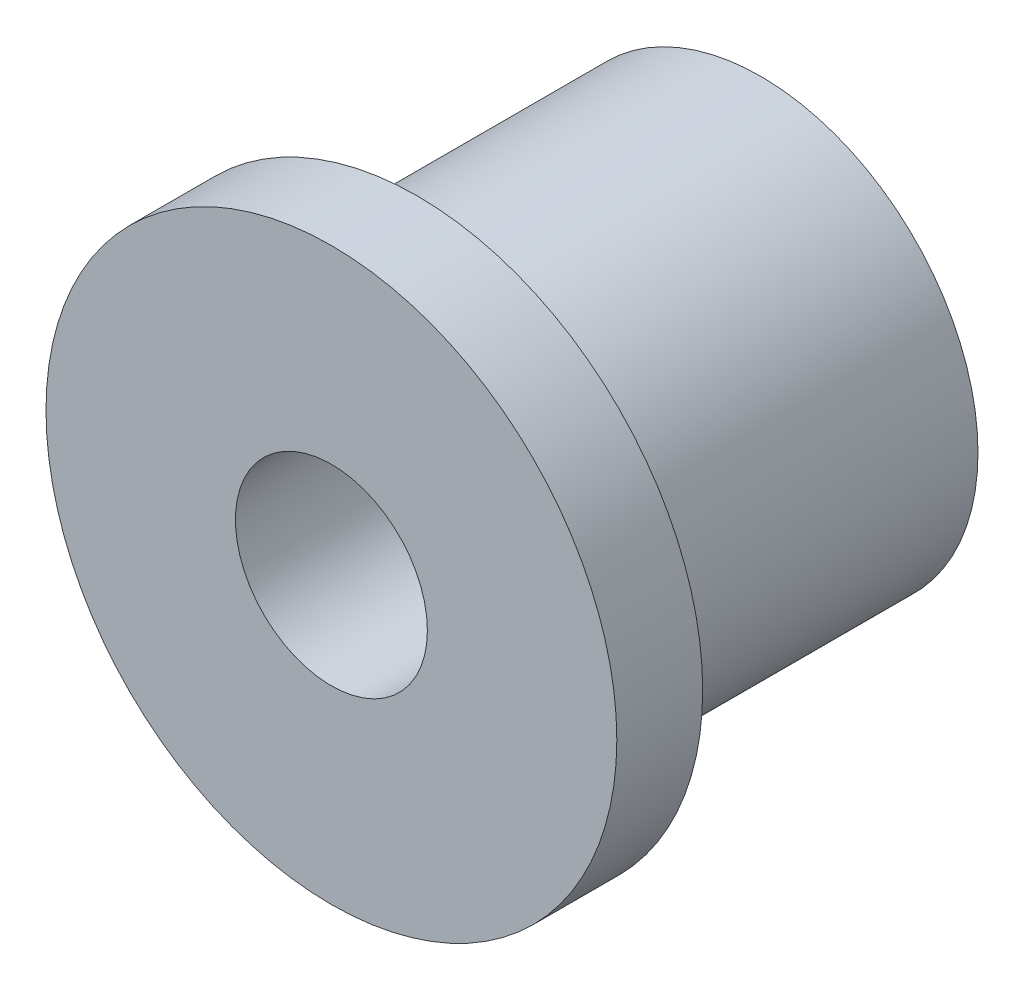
ISO-10303-21;
HEADER;
FILE_DESCRIPTION(('STEP AP214'),'2;1');
FILE_NAME('part.step','',(''),(''),'','','');
FILE_SCHEMA(('AUTOMOTIVE_DESIGN { 1 0 10303 214 1 1 1 1 }'));
ENDSEC;
DATA;
#1=APPLICATION_CONTEXT('core data for automotive mechanical design processes');
#2=APPLICATION_PROTOCOL_DEFINITION('international standard','automotive_design',2000,#1);
#3=PRODUCT_CONTEXT('',#1,'mechanical');
#4=PRODUCT('Part','Part','',(#3));
#5=PRODUCT_RELATED_PRODUCT_CATEGORY('part','',(#4));
#6=PRODUCT_DEFINITION_FORMATION('','',#4);
#7=PRODUCT_DEFINITION_CONTEXT('part definition',#1,'design');
#8=PRODUCT_DEFINITION('design','',#6,#7);
#9=PRODUCT_DEFINITION_SHAPE('','',#8);
#10=(LENGTH_UNIT() NAMED_UNIT(*) SI_UNIT(.MILLI.,.METRE.));
#11=(NAMED_UNIT(*) PLANE_ANGLE_UNIT() SI_UNIT($,.RADIAN.));
#12=(NAMED_UNIT(*) SI_UNIT($,.STERADIAN.) SOLID_ANGLE_UNIT());
#13=UNCERTAINTY_MEASURE_WITH_UNIT(LENGTH_MEASURE(1.E-05),#10,'distance_accuracy_value','');
#14=(GEOMETRIC_REPRESENTATION_CONTEXT(3) GLOBAL_UNCERTAINTY_ASSIGNED_CONTEXT((#13)) GLOBAL_UNIT_ASSIGNED_CONTEXT((#10,
#11,#12)) REPRESENTATION_CONTEXT('',''));
#15=CARTESIAN_POINT('',(0.,0.,0.));
#16=DIRECTION('',(0.,0.,1.));
#17=DIRECTION('',(1.,0.,0.));
#18=AXIS2_PLACEMENT_3D('',#15,#16,#17);
#19=CARTESIAN_POINT('',(0.,0.,8.636));
#20=DIRECTION('',(0.,0.,-1.));
#21=DIRECTION('',(-1.,0.,0.));
#22=AXIS2_PLACEMENT_3D('',#19,#20,#21);
#23=CYLINDRICAL_SURFACE('',#22,5.461);
#24=CARTESIAN_POINT('',(0.,0.,8.636));
#25=DIRECTION('',(0.,0.,1.));
#26=DIRECTION('',(1.,0.,0.));
#27=AXIS2_PLACEMENT_3D('',#24,#25,#26);
#28=CIRCLE('',#27,5.461);
#29=CARTESIAN_POINT('',(5.461,0.,8.636));
#30=VERTEX_POINT('',#29);
#31=EDGE_CURVE('E10',#30,#30,#28,.T.);
#32=ORIENTED_EDGE('',*,*,#31,.F.);
#33=EDGE_LOOP('',(#32));
#34=FACE_BOUND('',#33,.T.);
#35=CARTESIAN_POINT('',(0.,0.,0.));
#36=DIRECTION('',(0.,0.,1.));
#37=DIRECTION('',(1.,0.,0.));
#38=AXIS2_PLACEMENT_3D('',#35,#36,#37);
#39=CIRCLE('',#38,5.461);
#40=CARTESIAN_POINT('',(5.461,0.,0.));
#41=VERTEX_POINT('',#40);
#42=EDGE_CURVE('E35',#41,#41,#39,.T.);
#43=ORIENTED_EDGE('',*,*,#42,.T.);
#44=EDGE_LOOP('',(#43));
#45=FACE_BOUND('',#44,.T.);
#46=ADVANCED_FACE('F29',(#34,#45),#23,.T.);
#47=CARTESIAN_POINT('',(0.,0.,0.));
#48=DIRECTION('',(0.,0.,1.));
#49=DIRECTION('',(1.,0.,0.));
#50=AXIS2_PLACEMENT_3D('',#47,#48,#49);
#51=PLANE('',#50);
#52=ORIENTED_EDGE('',*,*,#42,.F.);
#53=EDGE_LOOP('',(#52));
#54=FACE_BOUND('',#53,.T.);
#55=ADVANCED_FACE('F71',(#54),#51,.F.);
#56=CARTESIAN_POINT('',(0.,0.,8.636));
#57=DIRECTION('',(0.,0.,1.));
#58=DIRECTION('',(1.,0.,0.));
#59=AXIS2_PLACEMENT_3D('',#56,#57,#58);
#60=PLANE('',#59);
#61=CARTESIAN_POINT('',(0.,0.,8.636));
#62=DIRECTION('',(0.,0.,1.));
#63=DIRECTION('',(1.,0.,0.));
#64=AXIS2_PLACEMENT_3D('',#61,#62,#63);
#65=CIRCLE('',#64,7.1755);
#66=CARTESIAN_POINT('',(7.1755,0.,8.636));
#67=VERTEX_POINT('',#66);
#68=EDGE_CURVE('E43',#67,#67,#65,.T.);
#69=ORIENTED_EDGE('',*,*,#68,.F.);
#70=EDGE_LOOP('',(#69));
#71=FACE_BOUND('',#70,.T.);
#72=ORIENTED_EDGE('',*,*,#31,.T.);
#73=EDGE_LOOP('',(#72));
#74=FACE_BOUND('',#73,.T.);
#75=ADVANCED_FACE('F66',(#71,#74),#60,.F.);
#76=CARTESIAN_POINT('',(0.,0.,10.795));
#77=DIRECTION('',(0.,0.,-1.));
#78=DIRECTION('',(-1.,0.,0.));
#79=AXIS2_PLACEMENT_3D('',#76,#77,#78);
#80=CYLINDRICAL_SURFACE('',#79,7.1755);
#81=CARTESIAN_POINT('',(0.,0.,10.795));
#82=DIRECTION('',(0.,0.,1.));
#83=DIRECTION('',(1.,0.,0.));
#84=AXIS2_PLACEMENT_3D('',#81,#82,#83);
#85=CIRCLE('',#84,7.1755);
#86=CARTESIAN_POINT('',(7.1755,0.,10.795));
#87=VERTEX_POINT('',#86);
#88=EDGE_CURVE('E39',#87,#87,#85,.T.);
#89=ORIENTED_EDGE('',*,*,#88,.F.);
#90=EDGE_LOOP('',(#89));
#91=FACE_BOUND('',#90,.T.);
#92=ORIENTED_EDGE('',*,*,#68,.T.);
#93=EDGE_LOOP('',(#92));
#94=FACE_BOUND('',#93,.T.);
#95=ADVANCED_FACE('F60',(#91,#94),#80,.T.);
#96=CARTESIAN_POINT('',(0.,0.,10.795));
#97=DIRECTION('',(0.,0.,1.));
#98=DIRECTION('',(1.,0.,0.));
#99=AXIS2_PLACEMENT_3D('',#96,#97,#98);
#100=PLANE('',#99);
#101=CARTESIAN_POINT('',(0.,0.,10.795));
#102=DIRECTION('',(0.,0.,1.));
#103=DIRECTION('',(1.,0.,0.));
#104=AXIS2_PLACEMENT_3D('',#101,#102,#103);
#105=CIRCLE('',#104,2.413);
#106=CARTESIAN_POINT('',(2.413,0.,10.795));
#107=VERTEX_POINT('',#106);
#108=EDGE_CURVE('E51',#107,#107,#105,.T.);
#109=ORIENTED_EDGE('',*,*,#108,.F.);
#110=EDGE_LOOP('',(#109));
#111=FACE_BOUND('',#110,.T.);
#112=ORIENTED_EDGE('',*,*,#88,.T.);
#113=EDGE_LOOP('',(#112));
#114=FACE_BOUND('',#113,.T.);
#115=ADVANCED_FACE('F57',(#111,#114),#100,.T.);
#116=CARTESIAN_POINT('',(0.,0.,2.921));
#117=DIRECTION('',(0.,0.,1.));
#118=DIRECTION('',(1.,0.,0.));
#119=AXIS2_PLACEMENT_3D('',#116,#117,#118);
#120=CYLINDRICAL_SURFACE('',#119,2.413);
#121=CARTESIAN_POINT('',(0.,0.,2.921));
#122=DIRECTION('',(0.,0.,1.));
#123=DIRECTION('',(1.,0.,0.));
#124=AXIS2_PLACEMENT_3D('',#121,#122,#123);
#125=CIRCLE('',#124,2.413);
#126=CARTESIAN_POINT('',(2.413,0.,2.921));
#127=VERTEX_POINT('',#126);
#128=EDGE_CURVE('E48',#127,#127,#125,.T.);
#129=ORIENTED_EDGE('',*,*,#128,.F.);
#130=EDGE_LOOP('',(#129));
#131=FACE_BOUND('',#130,.T.);
#132=ORIENTED_EDGE('',*,*,#108,.T.);
#133=EDGE_LOOP('',(#132));
#134=FACE_BOUND('',#133,.T.);
#135=ADVANCED_FACE('F55',(#131,#134),#120,.F.);
#136=CARTESIAN_POINT('',(0.,0.,2.921));
#137=DIRECTION('',(0.,0.,1.));
#138=DIRECTION('',(1.,0.,0.));
#139=AXIS2_PLACEMENT_3D('',#136,#137,#138);
#140=PLANE('',#139);
#141=ORIENTED_EDGE('',*,*,#128,.T.);
#142=EDGE_LOOP('',(#141));
#143=FACE_BOUND('',#142,.T.);
#144=ADVANCED_FACE('F111',(#143),#140,.T.);
#145=CLOSED_SHELL('',(#46,#55,#75,#95,#115,#135,#144));
#146=MANIFOLD_SOLID_BREP('B2',#145);
#147=ADVANCED_BREP_SHAPE_REPRESENTATION('',(#18,#146),#14);
#148=SHAPE_DEFINITION_REPRESENTATION(#9,#147);
ENDSEC;
END-ISO-10303-21;
